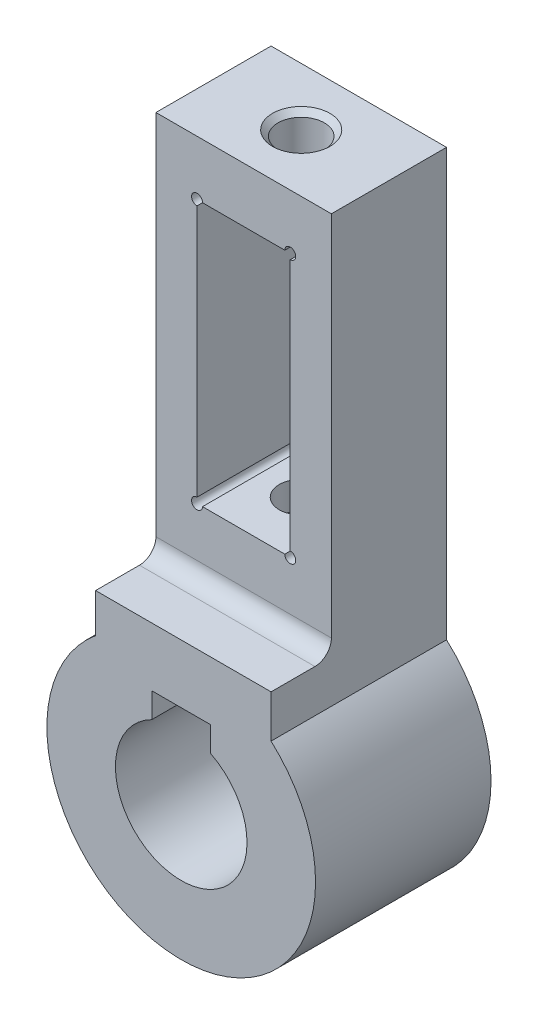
ISO-10303-21;
HEADER;
FILE_DESCRIPTION(('STEP AP214'),'2;1');
FILE_NAME('part.step','',(''),(''),'','','');
FILE_SCHEMA(('AUTOMOTIVE_DESIGN { 1 0 10303 214 1 1 1 1 }'));
ENDSEC;
DATA;
#1=APPLICATION_CONTEXT('core data for automotive mechanical design processes');
#2=APPLICATION_PROTOCOL_DEFINITION('international standard','automotive_design',2000,#1);
#3=PRODUCT_CONTEXT('',#1,'mechanical');
#4=PRODUCT('Part','Part','',(#3));
#5=PRODUCT_RELATED_PRODUCT_CATEGORY('part','',(#4));
#6=PRODUCT_DEFINITION_FORMATION('','',#4);
#7=PRODUCT_DEFINITION_CONTEXT('part definition',#1,'design');
#8=PRODUCT_DEFINITION('design','',#6,#7);
#9=PRODUCT_DEFINITION_SHAPE('','',#8);
#10=(LENGTH_UNIT() NAMED_UNIT(*) SI_UNIT(.MILLI.,.METRE.));
#11=(NAMED_UNIT(*) PLANE_ANGLE_UNIT() SI_UNIT($,.RADIAN.));
#12=(NAMED_UNIT(*) SI_UNIT($,.STERADIAN.) SOLID_ANGLE_UNIT());
#13=UNCERTAINTY_MEASURE_WITH_UNIT(LENGTH_MEASURE(1.E-05),#10,'distance_accuracy_value','');
#14=(GEOMETRIC_REPRESENTATION_CONTEXT(3) GLOBAL_UNCERTAINTY_ASSIGNED_CONTEXT((#13)) GLOBAL_UNIT_ASSIGNED_CONTEXT((#10,
#11,#12)) REPRESENTATION_CONTEXT('',''));
#15=CARTESIAN_POINT('',(0.,0.,0.));
#16=DIRECTION('',(0.,0.,1.));
#17=DIRECTION('',(1.,0.,0.));
#18=AXIS2_PLACEMENT_3D('',#15,#16,#17);
#19=CARTESIAN_POINT('',(16.,0.,21.));
#20=DIRECTION('',(1.,0.,0.));
#21=DIRECTION('',(0.,0.,-1.));
#22=AXIS2_PLACEMENT_3D('',#19,#20,#21);
#23=PLANE('',#22);
#24=DIRECTION('',(0.,-1.,0.));
#25=VECTOR('',#24,1.);
#26=CARTESIAN_POINT('',(16.,0.,0.));
#27=LINE('',#26,#25);
#28=CARTESIAN_POINT('',(16.,34.,0.));
#29=VERTEX_POINT('',#28);
#30=CARTESIAN_POINT('',(16.,-43.7842080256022,0.));
#31=VERTEX_POINT('',#30);
#32=EDGE_CURVE('E346',#29,#31,#27,.T.);
#33=ORIENTED_EDGE('',*,*,#32,.F.);
#34=DIRECTION('',(0.,0.,-1.));
#35=VECTOR('',#34,1.);
#36=CARTESIAN_POINT('',(16.,34.,21.));
#37=LINE('',#36,#35);
#38=CARTESIAN_POINT('',(16.,34.,21.));
#39=VERTEX_POINT('',#38);
#40=EDGE_CURVE('E358',#39,#29,#37,.T.);
#41=ORIENTED_EDGE('',*,*,#40,.F.);
#42=DIRECTION('',(0.,-1.,0.));
#43=VECTOR('',#42,1.);
#44=CARTESIAN_POINT('',(16.,0.,21.));
#45=LINE('',#44,#43);
#46=CARTESIAN_POINT('',(16.,-33.,21.));
#47=VERTEX_POINT('',#46);
#48=EDGE_CURVE('E305',#39,#47,#45,.T.);
#49=ORIENTED_EDGE('',*,*,#48,.T.);
#50=CARTESIAN_POINT('',(16.,-33.,24.));
#51=DIRECTION('',(1.,0.,0.));
#52=DIRECTION('',(0.,0.,-1.));
#53=AXIS2_PLACEMENT_3D('',#50,#51,#52);
#54=CIRCLE('',#53,3.);
#55=CARTESIAN_POINT('',(16.,-36.,24.));
#56=VERTEX_POINT('',#55);
#57=EDGE_CURVE('E63',#47,#56,#54,.F.);
#58=ORIENTED_EDGE('',*,*,#57,.T.);
#59=DIRECTION('',(0.,0.,-1.));
#60=VECTOR('',#59,1.);
#61=CARTESIAN_POINT('',(16.,-36.,32.));
#62=LINE('',#61,#60);
#63=CARTESIAN_POINT('',(16.,-36.,32.));
#64=VERTEX_POINT('',#63);
#65=EDGE_CURVE('E252',#64,#56,#62,.T.);
#66=ORIENTED_EDGE('',*,*,#65,.F.);
#67=DIRECTION('',(0.,-1.,0.));
#68=VECTOR('',#67,1.);
#69=CARTESIAN_POINT('',(16.,0.,32.));
#70=LINE('',#69,#68);
#71=CARTESIAN_POINT('',(16.,-43.7842080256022,32.));
#72=VERTEX_POINT('',#71);
#73=EDGE_CURVE('E223',#64,#72,#70,.T.);
#74=ORIENTED_EDGE('',*,*,#73,.T.);
#75=DIRECTION('',(0.,0.,-1.));
#76=VECTOR('',#75,1.);
#77=CARTESIAN_POINT('',(16.,-43.7842080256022,32.));
#78=LINE('',#77,#76);
#79=EDGE_CURVE('E256',#72,#31,#78,.T.);
#80=ORIENTED_EDGE('',*,*,#79,.T.);
#81=EDGE_LOOP('',(#33,#41,#49,#58,#66,#74,#80));
#82=FACE_BOUND('',#81,.T.);
#83=ADVANCED_FACE('F46',(#82),#23,.T.);
#84=CARTESIAN_POINT('',(0.,34.,21.));
#85=DIRECTION('',(0.,1.,0.));
#86=DIRECTION('',(0.,0.,1.));
#87=AXIS2_PLACEMENT_3D('',#84,#85,#86);
#88=PLANE('',#87);
#89=CARTESIAN_POINT('',(0.,34.,10.5));
#90=DIRECTION('',(0.,1.,0.));
#91=DIRECTION('',(0.,0.,1.));
#92=AXIS2_PLACEMENT_3D('',#89,#90,#91);
#93=CIRCLE('',#92,5.23126465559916);
#94=CARTESIAN_POINT('',(0.,34.,15.7312646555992));
#95=VERTEX_POINT('',#94);
#96=EDGE_CURVE('E11',#95,#95,#93,.F.);
#97=ORIENTED_EDGE('',*,*,#96,.T.);
#98=EDGE_LOOP('',(#97));
#99=FACE_BOUND('',#98,.T.);
#100=DIRECTION('',(1.,0.,0.));
#101=VECTOR('',#100,1.);
#102=CARTESIAN_POINT('',(0.,34.,0.));
#103=LINE('',#102,#101);
#104=CARTESIAN_POINT('',(-16.,34.,0.));
#105=VERTEX_POINT('',#104);
#106=EDGE_CURVE('E349',#105,#29,#103,.T.);
#107=ORIENTED_EDGE('',*,*,#106,.F.);
#108=DIRECTION('',(0.,0.,-1.));
#109=VECTOR('',#108,1.);
#110=CARTESIAN_POINT('',(-16.,34.,21.));
#111=LINE('',#110,#109);
#112=CARTESIAN_POINT('',(-16.,34.,21.));
#113=VERTEX_POINT('',#112);
#114=EDGE_CURVE('E355',#113,#105,#111,.T.);
#115=ORIENTED_EDGE('',*,*,#114,.F.);
#116=DIRECTION('',(1.,0.,0.));
#117=VECTOR('',#116,1.);
#118=CARTESIAN_POINT('',(0.,34.,21.));
#119=LINE('',#118,#117);
#120=EDGE_CURVE('E308',#113,#39,#119,.T.);
#121=ORIENTED_EDGE('',*,*,#120,.T.);
#122=ORIENTED_EDGE('',*,*,#40,.T.);
#123=EDGE_LOOP('',(#107,#115,#121,#122));
#124=FACE_BOUND('',#123,.T.);
#125=ADVANCED_FACE('F412',(#99,#124),#88,.T.);
#126=CARTESIAN_POINT('',(-16.,0.,21.));
#127=DIRECTION('',(1.,0.,0.));
#128=DIRECTION('',(0.,0.,-1.));
#129=AXIS2_PLACEMENT_3D('',#126,#127,#128);
#130=PLANE('',#129);
#131=DIRECTION('',(0.,-1.,0.));
#132=VECTOR('',#131,1.);
#133=CARTESIAN_POINT('',(-16.,0.,0.));
#134=LINE('',#133,#132);
#135=CARTESIAN_POINT('',(-16.,-43.1217046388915,0.));
#136=VERTEX_POINT('',#135);
#137=EDGE_CURVE('E281',#105,#136,#134,.T.);
#138=ORIENTED_EDGE('',*,*,#137,.T.);
#139=DIRECTION('',(0.,0.,-1.));
#140=VECTOR('',#139,1.);
#141=CARTESIAN_POINT('',(-16.,-43.1217046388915,32.));
#142=LINE('',#141,#140);
#143=CARTESIAN_POINT('',(-16.,-43.1217046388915,32.));
#144=VERTEX_POINT('',#143);
#145=EDGE_CURVE('E260',#144,#136,#142,.T.);
#146=ORIENTED_EDGE('',*,*,#145,.F.);
#147=DIRECTION('',(0.,-1.,0.));
#148=VECTOR('',#147,1.);
#149=CARTESIAN_POINT('',(-16.,0.,32.));
#150=LINE('',#149,#148);
#151=CARTESIAN_POINT('',(-16.,-36.,32.));
#152=VERTEX_POINT('',#151);
#153=EDGE_CURVE('E216',#152,#144,#150,.T.);
#154=ORIENTED_EDGE('',*,*,#153,.F.);
#155=DIRECTION('',(0.,0.,-1.));
#156=VECTOR('',#155,1.);
#157=CARTESIAN_POINT('',(-16.,-36.,32.));
#158=LINE('',#157,#156);
#159=CARTESIAN_POINT('',(-16.,-36.,24.));
#160=VERTEX_POINT('',#159);
#161=EDGE_CURVE('E249',#152,#160,#158,.T.);
#162=ORIENTED_EDGE('',*,*,#161,.T.);
#163=CARTESIAN_POINT('',(-16.,-33.,24.));
#164=DIRECTION('',(1.,0.,0.));
#165=DIRECTION('',(0.,0.,-1.));
#166=AXIS2_PLACEMENT_3D('',#163,#164,#165);
#167=CIRCLE('',#166,3.);
#168=CARTESIAN_POINT('',(-16.,-33.,21.));
#169=VERTEX_POINT('',#168);
#170=EDGE_CURVE('E394',#160,#169,#167,.T.);
#171=ORIENTED_EDGE('',*,*,#170,.T.);
#172=DIRECTION('',(0.,-1.,0.));
#173=VECTOR('',#172,1.);
#174=CARTESIAN_POINT('',(-16.,0.,21.));
#175=LINE('',#174,#173);
#176=EDGE_CURVE('E312',#113,#169,#175,.T.);
#177=ORIENTED_EDGE('',*,*,#176,.F.);
#178=ORIENTED_EDGE('',*,*,#114,.T.);
#179=EDGE_LOOP('',(#138,#146,#154,#162,#171,#177,#178));
#180=FACE_BOUND('',#179,.T.);
#181=ADVANCED_FACE('F418',(#180),#130,.F.);
#182=CARTESIAN_POINT('',(8.5,-24.,21.));
#183=DIRECTION('',(0.,0.,-1.));
#184=DIRECTION('',(-1.,0.,0.));
#185=AXIS2_PLACEMENT_3D('',#182,#183,#184);
#186=CYLINDRICAL_SURFACE('',#185,1.);
#187=CARTESIAN_POINT('',(8.5,-24.,0.));
#188=DIRECTION('',(0.,0.,1.));
#189=DIRECTION('',(1.,0.,0.));
#190=AXIS2_PLACEMENT_3D('',#187,#188,#189);
#191=CIRCLE('',#190,1.);
#192=CARTESIAN_POINT('',(7.5,-24.,0.));
#193=VERTEX_POINT('',#192);
#194=CARTESIAN_POINT('',(8.5,-23.,0.));
#195=VERTEX_POINT('',#194);
#196=EDGE_CURVE('E264',#193,#195,#191,.T.);
#197=ORIENTED_EDGE('',*,*,#196,.F.);
#198=DIRECTION('',(0.,0.,-1.));
#199=VECTOR('',#198,1.);
#200=CARTESIAN_POINT('',(7.5,-24.,21.));
#201=LINE('',#200,#199);
#202=CARTESIAN_POINT('',(7.5,-24.,21.));
#203=VERTEX_POINT('',#202);
#204=EDGE_CURVE('E359',#203,#193,#201,.T.);
#205=ORIENTED_EDGE('',*,*,#204,.F.);
#206=CARTESIAN_POINT('',(8.5,-24.,21.));
#207=DIRECTION('',(0.,0.,1.));
#208=DIRECTION('',(1.,0.,0.));
#209=AXIS2_PLACEMENT_3D('',#206,#207,#208);
#210=CIRCLE('',#209,1.);
#211=CARTESIAN_POINT('',(8.5,-23.,21.));
#212=VERTEX_POINT('',#211);
#213=EDGE_CURVE('E276',#203,#212,#210,.T.);
#214=ORIENTED_EDGE('',*,*,#213,.T.);
#215=DIRECTION('',(0.,0.,-1.));
#216=VECTOR('',#215,1.);
#217=CARTESIAN_POINT('',(8.5,-23.,21.));
#218=LINE('',#217,#216);
#219=EDGE_CURVE('E316',#212,#195,#218,.T.);
#220=ORIENTED_EDGE('',*,*,#219,.T.);
#221=EDGE_LOOP('',(#197,#205,#214,#220));
#222=FACE_BOUND('',#221,.T.);
#223=ADVANCED_FACE('F452',(#222),#186,.F.);
#224=CARTESIAN_POINT('',(0.,-24.,21.));
#225=DIRECTION('',(0.,1.,0.));
#226=DIRECTION('',(0.,0.,1.));
#227=AXIS2_PLACEMENT_3D('',#224,#225,#226);
#228=PLANE('',#227);
#229=CARTESIAN_POINT('',(0.,-24.,10.5));
#230=DIRECTION('',(0.,1.,0.));
#231=DIRECTION('',(0.,0.,1.));
#232=AXIS2_PLACEMENT_3D('',#229,#230,#231);
#233=CIRCLE('',#232,3.99999999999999);
#234=CARTESIAN_POINT('',(0.,-24.,14.5));
#235=VERTEX_POINT('',#234);
#236=EDGE_CURVE('E191',#235,#235,#233,.T.);
#237=ORIENTED_EDGE('',*,*,#236,.F.);
#238=EDGE_LOOP('',(#237));
#239=FACE_BOUND('',#238,.T.);
#240=DIRECTION('',(1.,0.,0.));
#241=VECTOR('',#240,1.);
#242=CARTESIAN_POINT('',(0.,-24.,0.));
#243=LINE('',#242,#241);
#244=CARTESIAN_POINT('',(-7.5,-24.,0.));
#245=VERTEX_POINT('',#244);
#246=EDGE_CURVE('E320',#245,#193,#243,.T.);
#247=ORIENTED_EDGE('',*,*,#246,.F.);
#248=DIRECTION('',(0.,0.,-1.));
#249=VECTOR('',#248,1.);
#250=CARTESIAN_POINT('',(-7.5,-24.,21.));
#251=LINE('',#250,#249);
#252=CARTESIAN_POINT('',(-7.5,-24.,21.));
#253=VERTEX_POINT('',#252);
#254=EDGE_CURVE('E382',#253,#245,#251,.T.);
#255=ORIENTED_EDGE('',*,*,#254,.F.);
#256=DIRECTION('',(1.,0.,0.));
#257=VECTOR('',#256,1.);
#258=CARTESIAN_POINT('',(0.,-24.,21.));
#259=LINE('',#258,#257);
#260=EDGE_CURVE('E280',#253,#203,#259,.T.);
#261=ORIENTED_EDGE('',*,*,#260,.T.);
#262=ORIENTED_EDGE('',*,*,#204,.T.);
#263=EDGE_LOOP('',(#247,#255,#261,#262));
#264=FACE_BOUND('',#263,.T.);
#265=ADVANCED_FACE('F448',(#239,#264),#228,.T.);
#266=CARTESIAN_POINT('',(-8.5,-24.,21.));
#267=DIRECTION('',(0.,0.,-1.));
#268=DIRECTION('',(-1.,0.,0.));
#269=AXIS2_PLACEMENT_3D('',#266,#267,#268);
#270=CYLINDRICAL_SURFACE('',#269,0.999999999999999);
#271=CARTESIAN_POINT('',(-8.5,-24.,0.));
#272=DIRECTION('',(0.,0.,1.));
#273=DIRECTION('',(1.,0.,0.));
#274=AXIS2_PLACEMENT_3D('',#271,#272,#273);
#275=CIRCLE('',#274,0.999999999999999);
#276=CARTESIAN_POINT('',(-8.5,-23.,0.));
#277=VERTEX_POINT('',#276);
#278=EDGE_CURVE('E324',#245,#277,#275,.F.);
#279=ORIENTED_EDGE('',*,*,#278,.T.);
#280=DIRECTION('',(0.,0.,-1.));
#281=VECTOR('',#280,1.);
#282=CARTESIAN_POINT('',(-8.5,-23.,21.));
#283=LINE('',#282,#281);
#284=CARTESIAN_POINT('',(-8.5,-23.,21.));
#285=VERTEX_POINT('',#284);
#286=EDGE_CURVE('E379',#285,#277,#283,.T.);
#287=ORIENTED_EDGE('',*,*,#286,.F.);
#288=CARTESIAN_POINT('',(-8.5,-24.,21.));
#289=DIRECTION('',(0.,0.,1.));
#290=DIRECTION('',(1.,0.,0.));
#291=AXIS2_PLACEMENT_3D('',#288,#289,#290);
#292=CIRCLE('',#291,0.999999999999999);
#293=EDGE_CURVE('E285',#253,#285,#292,.F.);
#294=ORIENTED_EDGE('',*,*,#293,.F.);
#295=ORIENTED_EDGE('',*,*,#254,.T.);
#296=EDGE_LOOP('',(#279,#287,#294,#295));
#297=FACE_BOUND('',#296,.T.);
#298=ADVANCED_FACE('F444',(#297),#270,.F.);
#299=CARTESIAN_POINT('',(-8.5,0.,21.));
#300=DIRECTION('',(1.,0.,0.));
#301=DIRECTION('',(0.,0.,-1.));
#302=AXIS2_PLACEMENT_3D('',#299,#300,#301);
#303=PLANE('',#302);
#304=DIRECTION('',(0.,-1.,0.));
#305=VECTOR('',#304,1.);
#306=CARTESIAN_POINT('',(-8.5,0.,0.));
#307=LINE('',#306,#305);
#308=CARTESIAN_POINT('',(-8.5,23.,0.));
#309=VERTEX_POINT('',#308);
#310=EDGE_CURVE('E328',#309,#277,#307,.T.);
#311=ORIENTED_EDGE('',*,*,#310,.F.);
#312=DIRECTION('',(0.,0.,-1.));
#313=VECTOR('',#312,1.);
#314=CARTESIAN_POINT('',(-8.5,23.,21.));
#315=LINE('',#314,#313);
#316=CARTESIAN_POINT('',(-8.5,23.,21.));
#317=VERTEX_POINT('',#316);
#318=EDGE_CURVE('E376',#317,#309,#315,.T.);
#319=ORIENTED_EDGE('',*,*,#318,.F.);
#320=DIRECTION('',(0.,-1.,0.));
#321=VECTOR('',#320,1.);
#322=CARTESIAN_POINT('',(-8.5,0.,21.));
#323=LINE('',#322,#321);
#324=EDGE_CURVE('E288',#317,#285,#323,.T.);
#325=ORIENTED_EDGE('',*,*,#324,.T.);
#326=ORIENTED_EDGE('',*,*,#286,.T.);
#327=EDGE_LOOP('',(#311,#319,#325,#326));
#328=FACE_BOUND('',#327,.T.);
#329=ADVANCED_FACE('F440',(#328),#303,.T.);
#330=CARTESIAN_POINT('',(-8.5,24.,21.));
#331=DIRECTION('',(0.,0.,-1.));
#332=DIRECTION('',(-1.,0.,0.));
#333=AXIS2_PLACEMENT_3D('',#330,#331,#332);
#334=CYLINDRICAL_SURFACE('',#333,1.);
#335=CARTESIAN_POINT('',(-8.5,24.,0.));
#336=DIRECTION('',(0.,0.,1.));
#337=DIRECTION('',(1.,0.,0.));
#338=AXIS2_PLACEMENT_3D('',#335,#336,#337);
#339=CIRCLE('',#338,1.);
#340=CARTESIAN_POINT('',(-7.5,24.,0.));
#341=VERTEX_POINT('',#340);
#342=EDGE_CURVE('E332',#341,#309,#339,.T.);
#343=ORIENTED_EDGE('',*,*,#342,.F.);
#344=DIRECTION('',(0.,0.,-1.));
#345=VECTOR('',#344,1.);
#346=CARTESIAN_POINT('',(-7.5,24.,21.));
#347=LINE('',#346,#345);
#348=CARTESIAN_POINT('',(-7.5,24.,21.));
#349=VERTEX_POINT('',#348);
#350=EDGE_CURVE('E373',#349,#341,#347,.T.);
#351=ORIENTED_EDGE('',*,*,#350,.F.);
#352=CARTESIAN_POINT('',(-8.5,24.,21.));
#353=DIRECTION('',(0.,0.,1.));
#354=DIRECTION('',(1.,0.,0.));
#355=AXIS2_PLACEMENT_3D('',#352,#353,#354);
#356=CIRCLE('',#355,1.);
#357=EDGE_CURVE('E292',#349,#317,#356,.T.);
#358=ORIENTED_EDGE('',*,*,#357,.T.);
#359=ORIENTED_EDGE('',*,*,#318,.T.);
#360=EDGE_LOOP('',(#343,#351,#358,#359));
#361=FACE_BOUND('',#360,.T.);
#362=ADVANCED_FACE('F436',(#361),#334,.F.);
#363=CARTESIAN_POINT('',(0.,24.,21.));
#364=DIRECTION('',(0.,1.,0.));
#365=DIRECTION('',(0.,0.,1.));
#366=AXIS2_PLACEMENT_3D('',#363,#364,#365);
#367=PLANE('',#366);
#368=CARTESIAN_POINT('',(0.,24.,10.5));
#369=DIRECTION('',(0.,1.,0.));
#370=DIRECTION('',(0.,0.,1.));
#371=AXIS2_PLACEMENT_3D('',#368,#369,#370);
#372=CIRCLE('',#371,4.23126465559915);
#373=CARTESIAN_POINT('',(0.,24.,14.7312646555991));
#374=VERTEX_POINT('',#373);
#375=EDGE_CURVE('E190',#374,#374,#372,.T.);
#376=ORIENTED_EDGE('',*,*,#375,.T.);
#377=EDGE_LOOP('',(#376));
#378=FACE_BOUND('',#377,.T.);
#379=DIRECTION('',(1.,0.,0.));
#380=VECTOR('',#379,1.);
#381=CARTESIAN_POINT('',(0.,24.,0.));
#382=LINE('',#381,#380);
#383=CARTESIAN_POINT('',(7.5,24.,0.));
#384=VERTEX_POINT('',#383);
#385=EDGE_CURVE('E336',#341,#384,#382,.T.);
#386=ORIENTED_EDGE('',*,*,#385,.T.);
#387=DIRECTION('',(0.,0.,-1.));
#388=VECTOR('',#387,1.);
#389=CARTESIAN_POINT('',(7.5,24.,21.));
#390=LINE('',#389,#388);
#391=CARTESIAN_POINT('',(7.5,24.,21.));
#392=VERTEX_POINT('',#391);
#393=EDGE_CURVE('E369',#392,#384,#390,.T.);
#394=ORIENTED_EDGE('',*,*,#393,.F.);
#395=DIRECTION('',(1.,0.,0.));
#396=VECTOR('',#395,1.);
#397=CARTESIAN_POINT('',(0.,24.,21.));
#398=LINE('',#397,#396);
#399=EDGE_CURVE('E296',#349,#392,#398,.T.);
#400=ORIENTED_EDGE('',*,*,#399,.F.);
#401=ORIENTED_EDGE('',*,*,#350,.T.);
#402=EDGE_LOOP('',(#386,#394,#400,#401));
#403=FACE_BOUND('',#402,.T.);
#404=ADVANCED_FACE('F432',(#378,#403),#367,.F.);
#405=CARTESIAN_POINT('',(8.5,24.,21.));
#406=DIRECTION('',(0.,0.,-1.));
#407=DIRECTION('',(-1.,0.,0.));
#408=AXIS2_PLACEMENT_3D('',#405,#406,#407);
#409=CYLINDRICAL_SURFACE('',#408,1.);
#410=CARTESIAN_POINT('',(8.5,24.,0.));
#411=DIRECTION('',(0.,0.,1.));
#412=DIRECTION('',(1.,0.,0.));
#413=AXIS2_PLACEMENT_3D('',#410,#411,#412);
#414=CIRCLE('',#413,1.);
#415=CARTESIAN_POINT('',(8.5,23.,0.));
#416=VERTEX_POINT('',#415);
#417=EDGE_CURVE('E339',#384,#416,#414,.F.);
#418=ORIENTED_EDGE('',*,*,#417,.T.);
#419=DIRECTION('',(0.,0.,-1.));
#420=VECTOR('',#419,1.);
#421=CARTESIAN_POINT('',(8.5,23.,21.));
#422=LINE('',#421,#420);
#423=CARTESIAN_POINT('',(8.5,23.,21.));
#424=VERTEX_POINT('',#423);
#425=EDGE_CURVE('E365',#424,#416,#422,.T.);
#426=ORIENTED_EDGE('',*,*,#425,.F.);
#427=CARTESIAN_POINT('',(8.5,24.,21.));
#428=DIRECTION('',(0.,0.,1.));
#429=DIRECTION('',(1.,0.,0.));
#430=AXIS2_PLACEMENT_3D('',#427,#428,#429);
#431=CIRCLE('',#430,1.);
#432=EDGE_CURVE('E299',#392,#424,#431,.F.);
#433=ORIENTED_EDGE('',*,*,#432,.F.);
#434=ORIENTED_EDGE('',*,*,#393,.T.);
#435=EDGE_LOOP('',(#418,#426,#433,#434));
#436=FACE_BOUND('',#435,.T.);
#437=ADVANCED_FACE('F428',(#436),#409,.F.);
#438=CARTESIAN_POINT('',(8.5,0.,21.));
#439=DIRECTION('',(1.,0.,0.));
#440=DIRECTION('',(0.,0.,-1.));
#441=AXIS2_PLACEMENT_3D('',#438,#439,#440);
#442=PLANE('',#441);
#443=DIRECTION('',(0.,-1.,0.));
#444=VECTOR('',#443,1.);
#445=CARTESIAN_POINT('',(8.5,0.,0.));
#446=LINE('',#445,#444);
#447=EDGE_CURVE('E342',#416,#195,#446,.T.);
#448=ORIENTED_EDGE('',*,*,#447,.T.);
#449=ORIENTED_EDGE('',*,*,#219,.F.);
#450=DIRECTION('',(0.,-1.,0.));
#451=VECTOR('',#450,1.);
#452=CARTESIAN_POINT('',(8.5,0.,21.));
#453=LINE('',#452,#451);
#454=EDGE_CURVE('E302',#424,#212,#453,.T.);
#455=ORIENTED_EDGE('',*,*,#454,.F.);
#456=ORIENTED_EDGE('',*,*,#425,.T.);
#457=EDGE_LOOP('',(#448,#449,#455,#456));
#458=FACE_BOUND('',#457,.T.);
#459=ADVANCED_FACE('F424',(#458),#442,.F.);
#460=CARTESIAN_POINT('',(0.,0.,21.));
#461=DIRECTION('',(0.,0.,1.));
#462=DIRECTION('',(1.,0.,0.));
#463=AXIS2_PLACEMENT_3D('',#460,#461,#462);
#464=PLANE('',#463);
#465=ORIENTED_EDGE('',*,*,#213,.F.);
#466=ORIENTED_EDGE('',*,*,#260,.F.);
#467=ORIENTED_EDGE('',*,*,#293,.T.);
#468=ORIENTED_EDGE('',*,*,#324,.F.);
#469=ORIENTED_EDGE('',*,*,#357,.F.);
#470=ORIENTED_EDGE('',*,*,#399,.T.);
#471=ORIENTED_EDGE('',*,*,#432,.T.);
#472=ORIENTED_EDGE('',*,*,#454,.T.);
#473=EDGE_LOOP('',(#465,#466,#467,#468,#469,#470,#471,#472));
#474=FACE_BOUND('',#473,.T.);
#475=ORIENTED_EDGE('',*,*,#176,.T.);
#476=DIRECTION('',(1.,0.,0.));
#477=VECTOR('',#476,1.);
#478=CARTESIAN_POINT('',(16.,-33.,21.));
#479=LINE('',#478,#477);
#480=EDGE_CURVE('E362',#169,#47,#479,.T.);
#481=ORIENTED_EDGE('',*,*,#480,.T.);
#482=ORIENTED_EDGE('',*,*,#48,.F.);
#483=ORIENTED_EDGE('',*,*,#120,.F.);
#484=EDGE_LOOP('',(#475,#481,#482,#483));
#485=FACE_BOUND('',#484,.T.);
#486=ADVANCED_FACE('F427',(#474,#485),#464,.T.);
#487=CARTESIAN_POINT('',(0.,0.,0.));
#488=DIRECTION('',(0.,0.,1.));
#489=DIRECTION('',(1.,0.,0.));
#490=AXIS2_PLACEMENT_3D('',#487,#488,#489);
#491=PLANE('',#490);
#492=ORIENTED_EDGE('',*,*,#196,.T.);
#493=ORIENTED_EDGE('',*,*,#447,.F.);
#494=ORIENTED_EDGE('',*,*,#417,.F.);
#495=ORIENTED_EDGE('',*,*,#385,.F.);
#496=ORIENTED_EDGE('',*,*,#342,.T.);
#497=ORIENTED_EDGE('',*,*,#310,.T.);
#498=ORIENTED_EDGE('',*,*,#278,.F.);
#499=ORIENTED_EDGE('',*,*,#246,.T.);
#500=EDGE_LOOP('',(#492,#493,#494,#495,#496,#497,#498,#499));
#501=FACE_BOUND('',#500,.T.);
#502=ORIENTED_EDGE('',*,*,#32,.T.);
#503=CARTESIAN_POINT('',(-0.383983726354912,-62.,0.));
#504=DIRECTION('',(0.,0.,1.));
#505=DIRECTION('',(1.,0.,0.));
#506=AXIS2_PLACEMENT_3D('',#503,#504,#505);
#507=CIRCLE('',#506,24.5);
#508=EDGE_CURVE('E206',#136,#31,#507,.T.);
#509=ORIENTED_EDGE('',*,*,#508,.F.);
#510=ORIENTED_EDGE('',*,*,#137,.F.);
#511=ORIENTED_EDGE('',*,*,#106,.T.);
#512=EDGE_LOOP('',(#502,#509,#510,#511));
#513=FACE_BOUND('',#512,.T.);
#514=DIRECTION('',(0.,1.,0.));
#515=VECTOR('',#514,1.);
#516=CARTESIAN_POINT('',(4.98942557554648,0.,0.));
#517=LINE('',#516,#515);
#518=CARTESIAN_POINT('',(4.98942557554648,-51.2702995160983,0.));
#519=VERTEX_POINT('',#518);
#520=CARTESIAN_POINT('',(4.98942557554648,-46.7,0.));
#521=VERTEX_POINT('',#520);
#522=EDGE_CURVE('E196',#519,#521,#517,.T.);
#523=ORIENTED_EDGE('',*,*,#522,.T.);
#524=DIRECTION('',(1.,0.,0.));
#525=VECTOR('',#524,1.);
#526=CARTESIAN_POINT('',(0.,-46.7,0.));
#527=LINE('',#526,#525);
#528=CARTESIAN_POINT('',(-5.75739302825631,-46.7,0.));
#529=VERTEX_POINT('',#528);
#530=EDGE_CURVE('E242',#529,#521,#527,.T.);
#531=ORIENTED_EDGE('',*,*,#530,.F.);
#532=DIRECTION('',(0.,1.,0.));
#533=VECTOR('',#532,1.);
#534=CARTESIAN_POINT('',(-5.75739302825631,0.,0.));
#535=LINE('',#534,#533);
#536=CARTESIAN_POINT('',(-5.75739302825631,-51.2702995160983,0.));
#537=VERTEX_POINT('',#536);
#538=EDGE_CURVE('E239',#537,#529,#535,.T.);
#539=ORIENTED_EDGE('',*,*,#538,.F.);
#540=CARTESIAN_POINT('',(-0.383983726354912,-62.,0.));
#541=DIRECTION('',(0.,0.,1.));
#542=DIRECTION('',(1.,0.,0.));
#543=AXIS2_PLACEMENT_3D('',#540,#541,#542);
#544=CIRCLE('',#543,12.);
#545=EDGE_CURVE('E235',#537,#519,#544,.T.);
#546=ORIENTED_EDGE('',*,*,#545,.T.);
#547=EDGE_LOOP('',(#523,#531,#539,#546));
#548=FACE_BOUND('',#547,.T.);
#549=ADVANCED_FACE('F479',(#501,#513,#548),#491,.F.);
#550=CARTESIAN_POINT('',(0.,-36.,32.));
#551=DIRECTION('',(0.,1.,0.));
#552=DIRECTION('',(0.,0.,1.));
#553=AXIS2_PLACEMENT_3D('',#550,#551,#552);
#554=PLANE('',#553);
#555=ORIENTED_EDGE('',*,*,#65,.T.);
#556=DIRECTION('',(1.,0.,0.));
#557=VECTOR('',#556,1.);
#558=CARTESIAN_POINT('',(-16.,-36.,24.));
#559=LINE('',#558,#557);
#560=EDGE_CURVE('E70',#56,#160,#559,.F.);
#561=ORIENTED_EDGE('',*,*,#560,.T.);
#562=ORIENTED_EDGE('',*,*,#161,.F.);
#563=DIRECTION('',(1.,0.,0.));
#564=VECTOR('',#563,1.);
#565=CARTESIAN_POINT('',(0.,-36.,32.));
#566=LINE('',#565,#564);
#567=EDGE_CURVE('E227',#152,#64,#566,.T.);
#568=ORIENTED_EDGE('',*,*,#567,.T.);
#569=EDGE_LOOP('',(#555,#561,#562,#568));
#570=FACE_BOUND('',#569,.T.);
#571=ADVANCED_FACE('F487',(#570),#554,.T.);
#572=CARTESIAN_POINT('',(-0.383983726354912,-62.,32.));
#573=DIRECTION('',(0.,0.,-1.));
#574=DIRECTION('',(-1.,0.,0.));
#575=AXIS2_PLACEMENT_3D('',#572,#573,#574);
#576=CYLINDRICAL_SURFACE('',#575,24.5);
#577=ORIENTED_EDGE('',*,*,#508,.T.);
#578=ORIENTED_EDGE('',*,*,#79,.F.);
#579=CARTESIAN_POINT('',(-0.383983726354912,-62.,32.));
#580=DIRECTION('',(0.,0.,1.));
#581=DIRECTION('',(1.,0.,0.));
#582=AXIS2_PLACEMENT_3D('',#579,#580,#581);
#583=CIRCLE('',#582,24.5);
#584=EDGE_CURVE('E220',#144,#72,#583,.T.);
#585=ORIENTED_EDGE('',*,*,#584,.F.);
#586=ORIENTED_EDGE('',*,*,#145,.T.);
#587=EDGE_LOOP('',(#577,#578,#585,#586));
#588=FACE_BOUND('',#587,.T.);
#589=ADVANCED_FACE('F483',(#588),#576,.T.);
#590=CARTESIAN_POINT('',(4.98942557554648,0.,32.));
#591=DIRECTION('',(-1.,0.,0.));
#592=DIRECTION('',(0.,0.,1.));
#593=AXIS2_PLACEMENT_3D('',#590,#591,#592);
#594=PLANE('',#593);
#595=ORIENTED_EDGE('',*,*,#522,.F.);
#596=DIRECTION('',(0.,0.,-1.));
#597=VECTOR('',#596,1.);
#598=CARTESIAN_POINT('',(4.98942557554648,-51.2702995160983,32.));
#599=LINE('',#598,#597);
#600=CARTESIAN_POINT('',(4.98942557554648,-51.2702995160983,32.));
#601=VERTEX_POINT('',#600);
#602=EDGE_CURVE('E253',#601,#519,#599,.T.);
#603=ORIENTED_EDGE('',*,*,#602,.F.);
#604=DIRECTION('',(0.,1.,0.));
#605=VECTOR('',#604,1.);
#606=CARTESIAN_POINT('',(4.98942557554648,0.,32.));
#607=LINE('',#606,#605);
#608=CARTESIAN_POINT('',(4.98942557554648,-46.7,32.));
#609=VERTEX_POINT('',#608);
#610=EDGE_CURVE('E201',#601,#609,#607,.T.);
#611=ORIENTED_EDGE('',*,*,#610,.T.);
#612=DIRECTION('',(0.,0.,-1.));
#613=VECTOR('',#612,1.);
#614=CARTESIAN_POINT('',(4.98942557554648,-46.7,32.));
#615=LINE('',#614,#613);
#616=EDGE_CURVE('E231',#609,#521,#615,.T.);
#617=ORIENTED_EDGE('',*,*,#616,.T.);
#618=EDGE_LOOP('',(#595,#603,#611,#617));
#619=FACE_BOUND('',#618,.T.);
#620=ADVANCED_FACE('F494',(#619),#594,.T.);
#621=CARTESIAN_POINT('',(-0.383983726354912,-62.,32.));
#622=DIRECTION('',(0.,0.,-1.));
#623=DIRECTION('',(-1.,0.,0.));
#624=AXIS2_PLACEMENT_3D('',#621,#622,#623);
#625=CYLINDRICAL_SURFACE('',#624,12.);
#626=ORIENTED_EDGE('',*,*,#545,.F.);
#627=DIRECTION('',(0.,0.,-1.));
#628=VECTOR('',#627,1.);
#629=CARTESIAN_POINT('',(-5.75739302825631,-51.2702995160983,32.));
#630=LINE('',#629,#628);
#631=CARTESIAN_POINT('',(-5.75739302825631,-51.2702995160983,32.));
#632=VERTEX_POINT('',#631);
#633=EDGE_CURVE('E271',#632,#537,#630,.T.);
#634=ORIENTED_EDGE('',*,*,#633,.F.);
#635=CARTESIAN_POINT('',(-0.383983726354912,-62.,32.));
#636=DIRECTION('',(0.,0.,1.));
#637=DIRECTION('',(1.,0.,0.));
#638=AXIS2_PLACEMENT_3D('',#635,#636,#637);
#639=CIRCLE('',#638,12.);
#640=EDGE_CURVE('E205',#632,#601,#639,.T.);
#641=ORIENTED_EDGE('',*,*,#640,.T.);
#642=ORIENTED_EDGE('',*,*,#602,.T.);
#643=EDGE_LOOP('',(#626,#634,#641,#642));
#644=FACE_BOUND('',#643,.T.);
#645=ADVANCED_FACE('F505',(#644),#625,.F.);
#646=CARTESIAN_POINT('',(-5.75739302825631,0.,32.));
#647=DIRECTION('',(-1.,0.,0.));
#648=DIRECTION('',(0.,0.,1.));
#649=AXIS2_PLACEMENT_3D('',#646,#647,#648);
#650=PLANE('',#649);
#651=ORIENTED_EDGE('',*,*,#538,.T.);
#652=DIRECTION('',(0.,0.,-1.));
#653=VECTOR('',#652,1.);
#654=CARTESIAN_POINT('',(-5.75739302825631,-46.7,32.));
#655=LINE('',#654,#653);
#656=CARTESIAN_POINT('',(-5.75739302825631,-46.7,32.));
#657=VERTEX_POINT('',#656);
#658=EDGE_CURVE('E267',#657,#529,#655,.T.);
#659=ORIENTED_EDGE('',*,*,#658,.F.);
#660=DIRECTION('',(0.,1.,0.));
#661=VECTOR('',#660,1.);
#662=CARTESIAN_POINT('',(-5.75739302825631,0.,32.));
#663=LINE('',#662,#661);
#664=EDGE_CURVE('E210',#632,#657,#663,.T.);
#665=ORIENTED_EDGE('',*,*,#664,.F.);
#666=ORIENTED_EDGE('',*,*,#633,.T.);
#667=EDGE_LOOP('',(#651,#659,#665,#666));
#668=FACE_BOUND('',#667,.T.);
#669=ADVANCED_FACE('F501',(#668),#650,.F.);
#670=CARTESIAN_POINT('',(0.,-46.7,32.));
#671=DIRECTION('',(0.,1.,0.));
#672=DIRECTION('',(0.,0.,1.));
#673=AXIS2_PLACEMENT_3D('',#670,#671,#672);
#674=PLANE('',#673);
#675=ORIENTED_EDGE('',*,*,#530,.T.);
#676=ORIENTED_EDGE('',*,*,#616,.F.);
#677=DIRECTION('',(1.,0.,0.));
#678=VECTOR('',#677,1.);
#679=CARTESIAN_POINT('',(0.,-46.7,32.));
#680=LINE('',#679,#678);
#681=EDGE_CURVE('E213',#657,#609,#680,.T.);
#682=ORIENTED_EDGE('',*,*,#681,.F.);
#683=ORIENTED_EDGE('',*,*,#658,.T.);
#684=EDGE_LOOP('',(#675,#676,#682,#683));
#685=FACE_BOUND('',#684,.T.);
#686=ADVANCED_FACE('F462',(#685),#674,.F.);
#687=CARTESIAN_POINT('',(0.,0.,32.));
#688=DIRECTION('',(0.,0.,1.));
#689=DIRECTION('',(1.,0.,0.));
#690=AXIS2_PLACEMENT_3D('',#687,#688,#689);
#691=PLANE('',#690);
#692=ORIENTED_EDGE('',*,*,#610,.F.);
#693=ORIENTED_EDGE('',*,*,#640,.F.);
#694=ORIENTED_EDGE('',*,*,#664,.T.);
#695=ORIENTED_EDGE('',*,*,#681,.T.);
#696=EDGE_LOOP('',(#692,#693,#694,#695));
#697=FACE_BOUND('',#696,.T.);
#698=ORIENTED_EDGE('',*,*,#153,.T.);
#699=ORIENTED_EDGE('',*,*,#584,.T.);
#700=ORIENTED_EDGE('',*,*,#73,.F.);
#701=ORIENTED_EDGE('',*,*,#567,.F.);
#702=EDGE_LOOP('',(#698,#699,#700,#701));
#703=FACE_BOUND('',#702,.T.);
#704=ADVANCED_FACE('F457',(#697,#703),#691,.T.);
#705=CARTESIAN_POINT('',(0.,-33.,24.));
#706=DIRECTION('',(-1.,0.,0.));
#707=DIRECTION('',(0.,0.,1.));
#708=AXIS2_PLACEMENT_3D('',#705,#706,#707);
#709=CYLINDRICAL_SURFACE('',#708,3.);
#710=ORIENTED_EDGE('',*,*,#170,.F.);
#711=ORIENTED_EDGE('',*,*,#560,.F.);
#712=ORIENTED_EDGE('',*,*,#57,.F.);
#713=ORIENTED_EDGE('',*,*,#480,.F.);
#714=EDGE_LOOP('',(#710,#711,#712,#713));
#715=FACE_BOUND('',#714,.T.);
#716=ADVANCED_FACE('F408',(#715),#709,.F.);
#717=CARTESIAN_POINT('',(0.,2.,10.5));
#718=DIRECTION('',(0.,1.,0.));
#719=DIRECTION('',(0.,0.,1.));
#720=AXIS2_PLACEMENT_3D('',#717,#718,#719);
#721=CYLINDRICAL_SURFACE('',#720,4.23126465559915);
#722=CARTESIAN_POINT('',(0.,33.,10.5));
#723=DIRECTION('',(0.,1.,0.));
#724=DIRECTION('',(0.,0.,1.));
#725=AXIS2_PLACEMENT_3D('',#722,#723,#724);
#726=CIRCLE('',#725,4.23126465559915);
#727=CARTESIAN_POINT('',(0.,33.,14.7312646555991));
#728=VERTEX_POINT('',#727);
#729=EDGE_CURVE('E56',#728,#728,#726,.T.);
#730=ORIENTED_EDGE('',*,*,#729,.T.);
#731=EDGE_LOOP('',(#730));
#732=FACE_BOUND('',#731,.T.);
#733=ORIENTED_EDGE('',*,*,#375,.F.);
#734=EDGE_LOOP('',(#733));
#735=FACE_BOUND('',#734,.T.);
#736=ADVANCED_FACE('F400',(#732,#735),#721,.F.);
#737=CARTESIAN_POINT('',(0.,33.,10.5));
#738=DIRECTION('',(0.,1.,0.));
#739=DIRECTION('',(0.,0.,1.));
#740=AXIS2_PLACEMENT_3D('',#737,#738,#739);
#741=CONICAL_SURFACE('',#740,4.23126465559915,0.785398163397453);
#742=ORIENTED_EDGE('',*,*,#96,.F.);
#743=EDGE_LOOP('',(#742));
#744=FACE_BOUND('',#743,.T.);
#745=ORIENTED_EDGE('',*,*,#729,.F.);
#746=EDGE_LOOP('',(#745));
#747=FACE_BOUND('',#746,.T.);
#748=ADVANCED_FACE('F49',(#744,#747),#741,.F.);
#749=CARTESIAN_POINT('',(0.,-29.,10.5));
#750=DIRECTION('',(0.,1.,0.));
#751=DIRECTION('',(0.,0.,1.));
#752=AXIS2_PLACEMENT_3D('',#749,#750,#751);
#753=CONICAL_SURFACE('',#752,4.,1.02974425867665);
#754=CARTESIAN_POINT('',(0.,-31.4034424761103,10.5));
#755=VERTEX_POINT('',#754);
#756=VERTEX_LOOP('',#755);
#757=FACE_BOUND('',#756,.T.);
#758=CARTESIAN_POINT('',(0.,-29.,10.5));
#759=DIRECTION('',(0.,1.,0.));
#760=DIRECTION('',(0.,0.,1.));
#761=AXIS2_PLACEMENT_3D('',#758,#759,#760);
#762=CIRCLE('',#761,4.);
#763=CARTESIAN_POINT('',(0.,-29.,14.5));
#764=VERTEX_POINT('',#763);
#765=EDGE_CURVE('E187',#764,#764,#762,.T.);
#766=ORIENTED_EDGE('',*,*,#765,.T.);
#767=EDGE_LOOP('',(#766));
#768=FACE_BOUND('',#767,.T.);
#769=ADVANCED_FACE('F180',(#757,#768),#753,.F.);
#770=CARTESIAN_POINT('',(0.,-24.,10.5));
#771=DIRECTION('',(0.,1.,0.));
#772=DIRECTION('',(0.,0.,1.));
#773=AXIS2_PLACEMENT_3D('',#770,#771,#772);
#774=CYLINDRICAL_SURFACE('',#773,3.99999999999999);
#775=ORIENTED_EDGE('',*,*,#765,.F.);
#776=EDGE_LOOP('',(#775));
#777=FACE_BOUND('',#776,.T.);
#778=ORIENTED_EDGE('',*,*,#236,.T.);
#779=EDGE_LOOP('',(#778));
#780=FACE_BOUND('',#779,.T.);
#781=ADVANCED_FACE('F183',(#777,#780),#774,.F.);
#782=CLOSED_SHELL('',(#83,#125,#181,#223,#265,#298,#329,#362,#404,#437,#459,#486,#549,#571,#589,
#620,#645,#669,#686,#704,#716,#736,#748,#769,#781));
#783=MANIFOLD_SOLID_BREP('B2',#782);
#784=ADVANCED_BREP_SHAPE_REPRESENTATION('',(#18,#783),#14);
#785=SHAPE_DEFINITION_REPRESENTATION(#9,#784);
ENDSEC;
END-ISO-10303-21;
